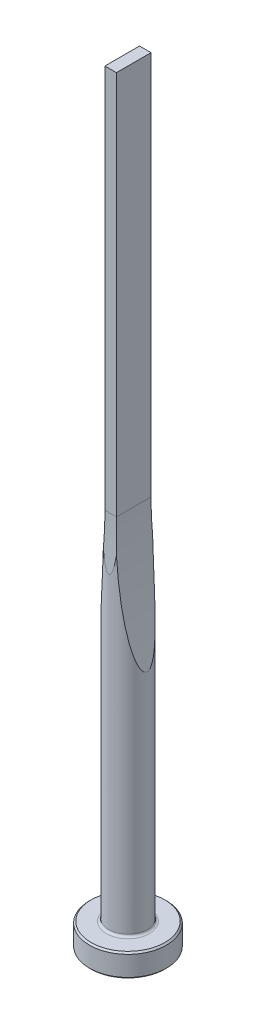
from build123d import *

# Parameters (mm, degrees)
CUT_EXTRUDE1_DEPTH = 5
CUT_EXTRUDE2_DEPTH = 5


with BuildPart() as part:
    # Sketch1 → Revolve1 (revolve)
    with BuildSketch(Plane.XY, mode=Mode.PRIVATE) as revolve1_sk:
        with BuildLine():
            Line((0, 0), (4.8, 0))
            Line((4.8, 0), (5, 0.2))
            Line((5, 0.2), (5, 2.8))
            Line((5, 2.8), (4.8, 3))
            Line((4.8, 3), (2.8, 3))
            ThreePointArc((2.8, 3), (2.587867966, 3.087867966), (2.5, 3.3))
            Line((2.5, 3.3), (2.5, 100))
            Line((2.5, 100), (0, 100))
            Line((0, 100), (0, 0))
        make_face()
    revolve(revolve1_sk.sketch.rotate(Axis((0, 100, 0), (0, -1, 0)), 180), axis=Axis((0, 100, 0), (0, -1, 0)))

    # Sketch2 → Cut-Extrude1 (cut, symmetric)
    with BuildSketch(Plane.XY):
        with BuildLine():
            Line((0.75, 100), (0.75, 50))
            ThreePointArc((0.75, 50), (1.188568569, 41.125880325), (2.5, 32.338247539))
            Line((2.5, 32.338247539), (2.5, 100))
            Line((2.5, 100), (0.75, 100))
        make_face()
        with BuildLine():
            Line((-0.75, 100), (-0.75, 50))
            ThreePointArc((-0.75, 50), (-1.188568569, 41.125880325), (-2.5, 32.338247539))
            Line((-2.5, 32.338247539), (-2.5, 100))
            Line((-2.5, 100), (-0.75, 100))
        make_face()
    extrude(amount=CUT_EXTRUDE1_DEPTH, both=True, mode=Mode.SUBTRACT)

    # Sketch3 → Cut-Extrude2 (cut, symmetric)
    with BuildSketch(Plane(origin=(0, 0, 0), x_dir=(0, 0, -1), z_dir=(1, 0, 0))):
        with BuildLine():
            Line((2.25, 100), (2.25, 50))
            ThreePointArc((2.25, 50), (2.312521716, 46.645898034), (2.5, 43.296456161))
            Line((2.5, 43.296456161), (2.5, 100))
            Line((2.5, 100), (2.25, 100))
        make_face()
        with BuildLine():
            Line((-2.25, 100), (-2.25, 50))
            ThreePointArc((-2.25, 50), (-2.312521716, 46.645898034), (-2.5, 43.296456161))
            Line((-2.5, 43.296456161), (-2.5, 100))
            Line((-2.5, 100), (-2.25, 100))
        make_face()
    extrude(amount=CUT_EXTRUDE2_DEPTH, both=True, mode=Mode.SUBTRACT)


solid = part.part
